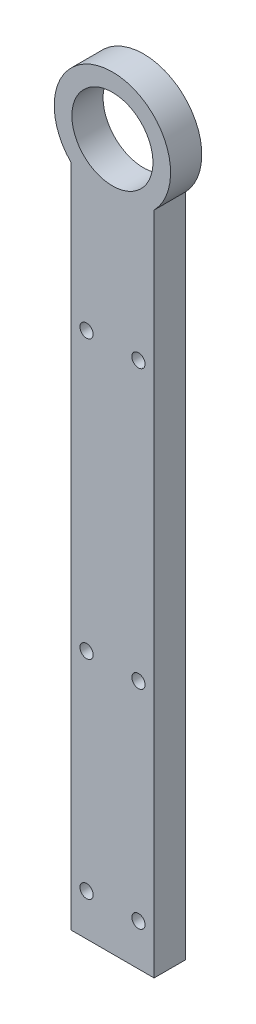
ISO-10303-21;
HEADER;
FILE_DESCRIPTION(('STEP AP214'),'2;1');
FILE_NAME('part.step','',(''),(''),'','','');
FILE_SCHEMA(('AUTOMOTIVE_DESIGN { 1 0 10303 214 1 1 1 1 }'));
ENDSEC;
DATA;
#1=APPLICATION_CONTEXT('core data for automotive mechanical design processes');
#2=APPLICATION_PROTOCOL_DEFINITION('international standard','automotive_design',2000,#1);
#3=PRODUCT_CONTEXT('',#1,'mechanical');
#4=PRODUCT('Part','Part','',(#3));
#5=PRODUCT_RELATED_PRODUCT_CATEGORY('part','',(#4));
#6=PRODUCT_DEFINITION_FORMATION('','',#4);
#7=PRODUCT_DEFINITION_CONTEXT('part definition',#1,'design');
#8=PRODUCT_DEFINITION('design','',#6,#7);
#9=PRODUCT_DEFINITION_SHAPE('','',#8);
#10=(LENGTH_UNIT() NAMED_UNIT(*) SI_UNIT(.MILLI.,.METRE.));
#11=(NAMED_UNIT(*) PLANE_ANGLE_UNIT() SI_UNIT($,.RADIAN.));
#12=(NAMED_UNIT(*) SI_UNIT($,.STERADIAN.) SOLID_ANGLE_UNIT());
#13=UNCERTAINTY_MEASURE_WITH_UNIT(LENGTH_MEASURE(1.E-05),#10,'distance_accuracy_value','');
#14=(GEOMETRIC_REPRESENTATION_CONTEXT(3) GLOBAL_UNCERTAINTY_ASSIGNED_CONTEXT((#13)) GLOBAL_UNIT_ASSIGNED_CONTEXT((#10,
#11,#12)) REPRESENTATION_CONTEXT('',''));
#15=CARTESIAN_POINT('',(0.,0.,0.));
#16=DIRECTION('',(0.,0.,1.));
#17=DIRECTION('',(1.,0.,0.));
#18=AXIS2_PLACEMENT_3D('',#15,#16,#17);
#19=CARTESIAN_POINT('',(0.,0.,9.525));
#20=DIRECTION('',(0.,0.,1.));
#21=DIRECTION('',(1.,0.,0.));
#22=AXIS2_PLACEMENT_3D('',#19,#20,#21);
#23=PLANE('',#22);
#24=CARTESIAN_POINT('',(-7.89318467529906,-139.411058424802,9.525));
#25=DIRECTION('',(0.,0.,1.));
#26=DIRECTION('',(1.,0.,0.));
#27=AXIS2_PLACEMENT_3D('',#24,#25,#26);
#28=CIRCLE('',#27,2.0193);
#29=CARTESIAN_POINT('',(-9.91248467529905,-139.411058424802,9.525));
#30=VERTEX_POINT('',#29);
#31=EDGE_CURVE('E139',#30,#30,#28,.T.);
#32=ORIENTED_EDGE('',*,*,#31,.F.);
#33=EDGE_LOOP('',(#32));
#34=FACE_BOUND('',#33,.T.);
#35=CARTESIAN_POINT('',(7.95641532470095,-202.911058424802,9.525));
#36=DIRECTION('',(0.,0.,1.));
#37=DIRECTION('',(1.,0.,0.));
#38=AXIS2_PLACEMENT_3D('',#35,#36,#37);
#39=CIRCLE('',#38,2.0193);
#40=CARTESIAN_POINT('',(5.93711532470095,-202.911058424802,9.525));
#41=VERTEX_POINT('',#40);
#42=EDGE_CURVE('E127',#41,#41,#39,.T.);
#43=ORIENTED_EDGE('',*,*,#42,.F.);
#44=EDGE_LOOP('',(#43));
#45=FACE_BOUND('',#44,.T.);
#46=CARTESIAN_POINT('',(-7.90588467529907,-54.6141933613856,9.525));
#47=DIRECTION('',(0.,0.,1.));
#48=DIRECTION('',(1.,0.,0.));
#49=AXIS2_PLACEMENT_3D('',#46,#47,#48);
#50=CIRCLE('',#49,2.0193);
#51=CARTESIAN_POINT('',(-9.92518467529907,-54.6141933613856,9.525));
#52=VERTEX_POINT('',#51);
#53=EDGE_CURVE('E115',#52,#52,#50,.T.);
#54=ORIENTED_EDGE('',*,*,#53,.F.);
#55=EDGE_LOOP('',(#54));
#56=FACE_BOUND('',#55,.T.);
#57=CARTESIAN_POINT('',(0.,0.,9.525));
#58=DIRECTION('',(0.,0.,1.));
#59=DIRECTION('',(1.,0.,0.));
#60=AXIS2_PLACEMENT_3D('',#57,#58,#59);
#61=CIRCLE('',#60,17.78);
#62=CARTESIAN_POINT('',(12.7316153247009,-12.4110584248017,9.525));
#63=VERTEX_POINT('',#62);
#64=CARTESIAN_POINT('',(-12.6683846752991,-12.4755933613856,9.525));
#65=VERTEX_POINT('',#64);
#66=EDGE_CURVE('E85',#63,#65,#61,.T.);
#67=ORIENTED_EDGE('',*,*,#66,.T.);
#68=DIRECTION('',(0.,-1.,0.));
#69=VECTOR('',#68,1.);
#70=CARTESIAN_POINT('',(-12.6683846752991,-12.4755933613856,9.525));
#71=LINE('',#70,#69);
#72=CARTESIAN_POINT('',(-12.6683846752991,-215.611058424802,9.525));
#73=VERTEX_POINT('',#72);
#74=EDGE_CURVE('E80',#65,#73,#71,.T.);
#75=ORIENTED_EDGE('',*,*,#74,.T.);
#76=DIRECTION('',(1.,0.,0.));
#77=VECTOR('',#76,1.);
#78=CARTESIAN_POINT('',(-12.6683846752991,-215.611058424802,9.525));
#79=LINE('',#78,#77);
#80=CARTESIAN_POINT('',(12.7316153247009,-215.611058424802,9.525));
#81=VERTEX_POINT('',#80);
#82=EDGE_CURVE('E83',#73,#81,#79,.T.);
#83=ORIENTED_EDGE('',*,*,#82,.T.);
#84=DIRECTION('',(0.,1.,0.));
#85=VECTOR('',#84,1.);
#86=CARTESIAN_POINT('',(12.7316153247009,-12.4110584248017,9.525));
#87=LINE('',#86,#85);
#88=EDGE_CURVE('E50',#81,#63,#87,.T.);
#89=ORIENTED_EDGE('',*,*,#88,.T.);
#90=EDGE_LOOP('',(#67,#75,#83,#89));
#91=FACE_BOUND('',#90,.T.);
#92=CARTESIAN_POINT('',(0.,0.,9.525));
#93=DIRECTION('',(0.,0.,1.));
#94=DIRECTION('',(1.,0.,0.));
#95=AXIS2_PLACEMENT_3D('',#92,#93,#94);
#96=CIRCLE('',#95,12.3825);
#97=CARTESIAN_POINT('',(-12.3825,0.,9.525));
#98=VERTEX_POINT('',#97);
#99=EDGE_CURVE('E100',#98,#98,#96,.T.);
#100=ORIENTED_EDGE('',*,*,#99,.F.);
#101=EDGE_LOOP('',(#100));
#102=FACE_BOUND('',#101,.T.);
#103=CARTESIAN_POINT('',(-7.89318467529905,-202.911058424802,9.525));
#104=DIRECTION('',(0.,0.,1.));
#105=DIRECTION('',(1.,0.,0.));
#106=AXIS2_PLACEMENT_3D('',#103,#104,#105);
#107=CIRCLE('',#106,2.01929999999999);
#108=CARTESIAN_POINT('',(-9.91248467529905,-202.911058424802,9.525));
#109=VERTEX_POINT('',#108);
#110=EDGE_CURVE('E121',#109,#109,#107,.T.);
#111=ORIENTED_EDGE('',*,*,#110,.F.);
#112=EDGE_LOOP('',(#111));
#113=FACE_BOUND('',#112,.T.);
#114=CARTESIAN_POINT('',(7.95641532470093,-54.5496584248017,9.525));
#115=DIRECTION('',(0.,0.,1.));
#116=DIRECTION('',(1.,0.,0.));
#117=AXIS2_PLACEMENT_3D('',#114,#115,#116);
#118=CIRCLE('',#117,2.0193);
#119=CARTESIAN_POINT('',(5.93711532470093,-54.5496584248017,9.525));
#120=VERTEX_POINT('',#119);
#121=EDGE_CURVE('E133',#120,#120,#118,.T.);
#122=ORIENTED_EDGE('',*,*,#121,.F.);
#123=EDGE_LOOP('',(#122));
#124=FACE_BOUND('',#123,.T.);
#125=CARTESIAN_POINT('',(7.95641532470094,-139.411058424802,9.525));
#126=DIRECTION('',(0.,0.,1.));
#127=DIRECTION('',(1.,0.,0.));
#128=AXIS2_PLACEMENT_3D('',#125,#126,#127);
#129=CIRCLE('',#128,2.01929999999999);
#130=CARTESIAN_POINT('',(5.93711532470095,-139.411058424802,9.525));
#131=VERTEX_POINT('',#130);
#132=EDGE_CURVE('E145',#131,#131,#129,.T.);
#133=ORIENTED_EDGE('',*,*,#132,.F.);
#134=EDGE_LOOP('',(#133));
#135=FACE_BOUND('',#134,.T.);
#136=ADVANCED_FACE('F33',(#34,#45,#56,#91,#102,#113,#124,#135),#23,.T.);
#137=CARTESIAN_POINT('',(0.,0.,0.));
#138=DIRECTION('',(0.,0.,1.));
#139=DIRECTION('',(1.,0.,0.));
#140=AXIS2_PLACEMENT_3D('',#137,#138,#139);
#141=PLANE('',#140);
#142=CARTESIAN_POINT('',(0.,0.,0.));
#143=DIRECTION('',(0.,0.,1.));
#144=DIRECTION('',(1.,0.,0.));
#145=AXIS2_PLACEMENT_3D('',#142,#143,#144);
#146=CIRCLE('',#145,17.78);
#147=CARTESIAN_POINT('',(12.7316153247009,-12.4110584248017,0.));
#148=VERTEX_POINT('',#147);
#149=CARTESIAN_POINT('',(-12.6683846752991,-12.4755933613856,0.));
#150=VERTEX_POINT('',#149);
#151=EDGE_CURVE('E97',#148,#150,#146,.T.);
#152=ORIENTED_EDGE('',*,*,#151,.F.);
#153=DIRECTION('',(0.,1.,0.));
#154=VECTOR('',#153,1.);
#155=CARTESIAN_POINT('',(12.7316153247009,-12.4110584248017,0.));
#156=LINE('',#155,#154);
#157=CARTESIAN_POINT('',(12.7316153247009,-215.611058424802,0.));
#158=VERTEX_POINT('',#157);
#159=EDGE_CURVE('E73',#158,#148,#156,.T.);
#160=ORIENTED_EDGE('',*,*,#159,.F.);
#161=DIRECTION('',(1.,0.,0.));
#162=VECTOR('',#161,1.);
#163=CARTESIAN_POINT('',(-12.6683846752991,-215.611058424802,0.));
#164=LINE('',#163,#162);
#165=CARTESIAN_POINT('',(-12.6683846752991,-215.611058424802,0.));
#166=VERTEX_POINT('',#165);
#167=EDGE_CURVE('E67',#166,#158,#164,.T.);
#168=ORIENTED_EDGE('',*,*,#167,.F.);
#169=DIRECTION('',(0.,-1.,0.));
#170=VECTOR('',#169,1.);
#171=CARTESIAN_POINT('',(-12.6683846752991,-12.4755933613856,0.));
#172=LINE('',#171,#170);
#173=EDGE_CURVE('E89',#150,#166,#172,.T.);
#174=ORIENTED_EDGE('',*,*,#173,.F.);
#175=EDGE_LOOP('',(#152,#160,#168,#174));
#176=FACE_BOUND('',#175,.T.);
#177=CARTESIAN_POINT('',(0.,0.,0.));
#178=DIRECTION('',(0.,0.,1.));
#179=DIRECTION('',(1.,0.,0.));
#180=AXIS2_PLACEMENT_3D('',#177,#178,#179);
#181=CIRCLE('',#180,12.3825);
#182=CARTESIAN_POINT('',(-12.3825,0.,0.));
#183=VERTEX_POINT('',#182);
#184=EDGE_CURVE('E112',#183,#183,#181,.T.);
#185=ORIENTED_EDGE('',*,*,#184,.T.);
#186=EDGE_LOOP('',(#185));
#187=FACE_BOUND('',#186,.T.);
#188=CARTESIAN_POINT('',(-7.90588467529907,-54.6141933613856,0.));
#189=DIRECTION('',(0.,0.,1.));
#190=DIRECTION('',(1.,0.,0.));
#191=AXIS2_PLACEMENT_3D('',#188,#189,#190);
#192=CIRCLE('',#191,2.0193);
#193=CARTESIAN_POINT('',(-9.92518467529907,-54.6141933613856,0.));
#194=VERTEX_POINT('',#193);
#195=EDGE_CURVE('E118',#194,#194,#192,.T.);
#196=ORIENTED_EDGE('',*,*,#195,.T.);
#197=EDGE_LOOP('',(#196));
#198=FACE_BOUND('',#197,.T.);
#199=CARTESIAN_POINT('',(-7.89318467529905,-202.911058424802,0.));
#200=DIRECTION('',(0.,0.,1.));
#201=DIRECTION('',(1.,0.,0.));
#202=AXIS2_PLACEMENT_3D('',#199,#200,#201);
#203=CIRCLE('',#202,2.01929999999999);
#204=CARTESIAN_POINT('',(-9.91248467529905,-202.911058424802,0.));
#205=VERTEX_POINT('',#204);
#206=EDGE_CURVE('E124',#205,#205,#203,.T.);
#207=ORIENTED_EDGE('',*,*,#206,.T.);
#208=EDGE_LOOP('',(#207));
#209=FACE_BOUND('',#208,.T.);
#210=CARTESIAN_POINT('',(7.95641532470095,-202.911058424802,0.));
#211=DIRECTION('',(0.,0.,1.));
#212=DIRECTION('',(1.,0.,0.));
#213=AXIS2_PLACEMENT_3D('',#210,#211,#212);
#214=CIRCLE('',#213,2.0193);
#215=CARTESIAN_POINT('',(5.93711532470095,-202.911058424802,0.));
#216=VERTEX_POINT('',#215);
#217=EDGE_CURVE('E130',#216,#216,#214,.T.);
#218=ORIENTED_EDGE('',*,*,#217,.T.);
#219=EDGE_LOOP('',(#218));
#220=FACE_BOUND('',#219,.T.);
#221=CARTESIAN_POINT('',(7.95641532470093,-54.5496584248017,0.));
#222=DIRECTION('',(0.,0.,1.));
#223=DIRECTION('',(1.,0.,0.));
#224=AXIS2_PLACEMENT_3D('',#221,#222,#223);
#225=CIRCLE('',#224,2.0193);
#226=CARTESIAN_POINT('',(5.93711532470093,-54.5496584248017,0.));
#227=VERTEX_POINT('',#226);
#228=EDGE_CURVE('E136',#227,#227,#225,.T.);
#229=ORIENTED_EDGE('',*,*,#228,.T.);
#230=EDGE_LOOP('',(#229));
#231=FACE_BOUND('',#230,.T.);
#232=CARTESIAN_POINT('',(-7.89318467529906,-139.411058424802,0.));
#233=DIRECTION('',(0.,0.,1.));
#234=DIRECTION('',(1.,0.,0.));
#235=AXIS2_PLACEMENT_3D('',#232,#233,#234);
#236=CIRCLE('',#235,2.0193);
#237=CARTESIAN_POINT('',(-9.91248467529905,-139.411058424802,0.));
#238=VERTEX_POINT('',#237);
#239=EDGE_CURVE('E142',#238,#238,#236,.T.);
#240=ORIENTED_EDGE('',*,*,#239,.T.);
#241=EDGE_LOOP('',(#240));
#242=FACE_BOUND('',#241,.T.);
#243=CARTESIAN_POINT('',(7.95641532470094,-139.411058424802,0.));
#244=DIRECTION('',(0.,0.,1.));
#245=DIRECTION('',(1.,0.,0.));
#246=AXIS2_PLACEMENT_3D('',#243,#244,#245);
#247=CIRCLE('',#246,2.01929999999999);
#248=CARTESIAN_POINT('',(5.93711532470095,-139.411058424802,0.));
#249=VERTEX_POINT('',#248);
#250=EDGE_CURVE('E148',#249,#249,#247,.T.);
#251=ORIENTED_EDGE('',*,*,#250,.T.);
#252=EDGE_LOOP('',(#251));
#253=FACE_BOUND('',#252,.T.);
#254=ADVANCED_FACE('F108',(#176,#187,#198,#209,#220,#231,#242,#253),#141,.F.);
#255=CARTESIAN_POINT('',(0.,0.,9.525));
#256=DIRECTION('',(0.,0.,-1.));
#257=DIRECTION('',(-1.,0.,0.));
#258=AXIS2_PLACEMENT_3D('',#255,#256,#257);
#259=CYLINDRICAL_SURFACE('',#258,17.78);
#260=ORIENTED_EDGE('',*,*,#151,.T.);
#261=DIRECTION('',(0.,0.,-1.));
#262=VECTOR('',#261,1.);
#263=CARTESIAN_POINT('',(-12.6683846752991,-12.4755933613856,9.525));
#264=LINE('',#263,#262);
#265=EDGE_CURVE('E11',#65,#150,#264,.T.);
#266=ORIENTED_EDGE('',*,*,#265,.F.);
#267=ORIENTED_EDGE('',*,*,#66,.F.);
#268=DIRECTION('',(0.,0.,-1.));
#269=VECTOR('',#268,1.);
#270=CARTESIAN_POINT('',(12.7316153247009,-12.4110584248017,9.525));
#271=LINE('',#270,#269);
#272=EDGE_CURVE('E93',#63,#148,#271,.T.);
#273=ORIENTED_EDGE('',*,*,#272,.T.);
#274=EDGE_LOOP('',(#260,#266,#267,#273));
#275=FACE_BOUND('',#274,.T.);
#276=ADVANCED_FACE('F35',(#275),#259,.T.);
#277=CARTESIAN_POINT('',(-12.6683846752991,-12.4755933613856,9.525));
#278=DIRECTION('',(1.,0.,0.));
#279=DIRECTION('',(0.,1.,0.));
#280=AXIS2_PLACEMENT_3D('',#277,#278,#279);
#281=PLANE('',#280);
#282=ORIENTED_EDGE('',*,*,#173,.T.);
#283=DIRECTION('',(0.,0.,-1.));
#284=VECTOR('',#283,1.);
#285=CARTESIAN_POINT('',(-12.6683846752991,-215.611058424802,9.525));
#286=LINE('',#285,#284);
#287=EDGE_CURVE('E42',#73,#166,#286,.T.);
#288=ORIENTED_EDGE('',*,*,#287,.F.);
#289=ORIENTED_EDGE('',*,*,#74,.F.);
#290=ORIENTED_EDGE('',*,*,#265,.T.);
#291=EDGE_LOOP('',(#282,#288,#289,#290));
#292=FACE_BOUND('',#291,.T.);
#293=ADVANCED_FACE('F88',(#292),#281,.F.);
#294=CARTESIAN_POINT('',(-12.6683846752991,-215.611058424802,9.525));
#295=DIRECTION('',(0.,1.,0.));
#296=DIRECTION('',(0.,0.,1.));
#297=AXIS2_PLACEMENT_3D('',#294,#295,#296);
#298=PLANE('',#297);
#299=ORIENTED_EDGE('',*,*,#167,.T.);
#300=DIRECTION('',(0.,0.,-1.));
#301=VECTOR('',#300,1.);
#302=CARTESIAN_POINT('',(12.7316153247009,-215.611058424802,9.525));
#303=LINE('',#302,#301);
#304=EDGE_CURVE('E90',#81,#158,#303,.T.);
#305=ORIENTED_EDGE('',*,*,#304,.F.);
#306=ORIENTED_EDGE('',*,*,#82,.F.);
#307=ORIENTED_EDGE('',*,*,#287,.T.);
#308=EDGE_LOOP('',(#299,#305,#306,#307));
#309=FACE_BOUND('',#308,.T.);
#310=ADVANCED_FACE('F91',(#309),#298,.F.);
#311=CARTESIAN_POINT('',(12.7316153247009,-12.4110584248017,9.525));
#312=DIRECTION('',(-1.,0.,0.));
#313=DIRECTION('',(0.,-1.,0.));
#314=AXIS2_PLACEMENT_3D('',#311,#312,#313);
#315=PLANE('',#314);
#316=ORIENTED_EDGE('',*,*,#159,.T.);
#317=ORIENTED_EDGE('',*,*,#272,.F.);
#318=ORIENTED_EDGE('',*,*,#88,.F.);
#319=ORIENTED_EDGE('',*,*,#304,.T.);
#320=EDGE_LOOP('',(#316,#317,#318,#319));
#321=FACE_BOUND('',#320,.T.);
#322=ADVANCED_FACE('F105',(#321),#315,.F.);
#323=CARTESIAN_POINT('',(0.,0.,9.525));
#324=DIRECTION('',(0.,0.,-1.));
#325=DIRECTION('',(-1.,0.,0.));
#326=AXIS2_PLACEMENT_3D('',#323,#324,#325);
#327=CYLINDRICAL_SURFACE('',#326,12.3825);
#328=CARTESIAN_POINT('',(-12.3825,0.,9.525));
#329=CARTESIAN_POINT('',(-12.3825,0.,9.42578125));
#330=CARTESIAN_POINT('',(-12.3825,0.,9.3265625));
#331=CARTESIAN_POINT('',(-12.3825,0.,9.128125));
#332=CARTESIAN_POINT('',(-12.3825,0.,9.02890625));
#333=CARTESIAN_POINT('',(-12.3825,0.,8.83046875));
#334=CARTESIAN_POINT('',(-12.3825,0.,8.73125));
#335=CARTESIAN_POINT('',(-12.3825,0.,8.5328125));
#336=CARTESIAN_POINT('',(-12.3825,0.,8.43359375));
#337=CARTESIAN_POINT('',(-12.3825,0.,8.23515625));
#338=CARTESIAN_POINT('',(-12.3825,0.,8.1359375));
#339=CARTESIAN_POINT('',(-12.3825,0.,7.9375));
#340=CARTESIAN_POINT('',(-12.3825,0.,7.83828125));
#341=CARTESIAN_POINT('',(-12.3825,0.,7.63984375));
#342=CARTESIAN_POINT('',(-12.3825,0.,7.540625));
#343=CARTESIAN_POINT('',(-12.3825,0.,7.3421875));
#344=CARTESIAN_POINT('',(-12.3825,0.,7.24296875));
#345=CARTESIAN_POINT('',(-12.3825,0.,7.04453125));
#346=CARTESIAN_POINT('',(-12.3825,0.,6.9453125));
#347=CARTESIAN_POINT('',(-12.3825,0.,6.746875));
#348=CARTESIAN_POINT('',(-12.3825,0.,6.64765625));
#349=CARTESIAN_POINT('',(-12.3825,0.,6.44921875));
#350=CARTESIAN_POINT('',(-12.3825,0.,6.35));
#351=CARTESIAN_POINT('',(-12.3825,0.,6.1515625));
#352=CARTESIAN_POINT('',(-12.3825,0.,6.05234375));
#353=CARTESIAN_POINT('',(-12.3825,0.,5.85390625));
#354=CARTESIAN_POINT('',(-12.3825,0.,5.7546875));
#355=CARTESIAN_POINT('',(-12.3825,0.,5.55625));
#356=CARTESIAN_POINT('',(-12.3825,0.,5.45703125));
#357=CARTESIAN_POINT('',(-12.3825,0.,5.25859375));
#358=CARTESIAN_POINT('',(-12.3825,0.,5.159375));
#359=CARTESIAN_POINT('',(-12.3825,0.,4.9609375));
#360=CARTESIAN_POINT('',(-12.3825,0.,4.86171875));
#361=CARTESIAN_POINT('',(-12.3825,0.,4.66328125));
#362=CARTESIAN_POINT('',(-12.3825,0.,4.5640625));
#363=CARTESIAN_POINT('',(-12.3825,0.,4.365625));
#364=CARTESIAN_POINT('',(-12.3825,0.,4.26640625));
#365=CARTESIAN_POINT('',(-12.3825,0.,4.06796875));
#366=CARTESIAN_POINT('',(-12.3825,0.,3.96875));
#367=CARTESIAN_POINT('',(-12.3825,0.,3.7703125));
#368=CARTESIAN_POINT('',(-12.3825,0.,3.67109375));
#369=CARTESIAN_POINT('',(-12.3825,0.,3.47265625));
#370=CARTESIAN_POINT('',(-12.3825,0.,3.3734375));
#371=CARTESIAN_POINT('',(-12.3825,0.,3.175));
#372=CARTESIAN_POINT('',(-12.3825,0.,3.07578125));
#373=CARTESIAN_POINT('',(-12.3825,0.,2.87734375));
#374=CARTESIAN_POINT('',(-12.3825,0.,2.778125));
#375=CARTESIAN_POINT('',(-12.3825,0.,2.5796875));
#376=CARTESIAN_POINT('',(-12.3825,0.,2.48046875));
#377=CARTESIAN_POINT('',(-12.3825,0.,2.28203125));
#378=CARTESIAN_POINT('',(-12.3825,0.,2.1828125));
#379=CARTESIAN_POINT('',(-12.3825,0.,1.984375));
#380=CARTESIAN_POINT('',(-12.3825,0.,1.88515625));
#381=CARTESIAN_POINT('',(-12.3825,0.,1.68671875));
#382=CARTESIAN_POINT('',(-12.3825,0.,1.5875));
#383=CARTESIAN_POINT('',(-12.3825,0.,1.3890625));
#384=CARTESIAN_POINT('',(-12.3825,0.,1.28984375));
#385=CARTESIAN_POINT('',(-12.3825,0.,1.09140625));
#386=CARTESIAN_POINT('',(-12.3825,0.,0.992187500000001));
#387=CARTESIAN_POINT('',(-12.3825,0.,0.793750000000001));
#388=CARTESIAN_POINT('',(-12.3825,0.,0.69453125));
#389=CARTESIAN_POINT('',(-12.3825,0.,0.49609375));
#390=CARTESIAN_POINT('',(-12.3825,0.,0.396875));
#391=CARTESIAN_POINT('',(-12.3825,0.,0.1984375));
#392=CARTESIAN_POINT('',(-12.3825,0.,0.0992187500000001));
#393=CARTESIAN_POINT('',(-12.3825,0.,0.));
#394=B_SPLINE_CURVE_WITH_KNOTS('',3,(#328,#329,#330,#331,#332,#333,#334,#335,#336,#337,#338,
#339,#340,#341,#342,#343,#344,#345,#346,#347,#348,#349,#350,#351,#352,#353,#354,#355,#356,#357,
#358,#359,#360,#361,#362,#363,#364,#365,#366,#367,#368,#369,#370,#371,#372,#373,#374,#375,#376,
#377,#378,#379,#380,#381,#382,#383,#384,#385,#386,#387,#388,#389,#390,#391,#392,#393),
.UNSPECIFIED.,.F.,.F.,(4,2,2,2,2,2,2,2,2,2,2,2,2,2,2,2,2,2,2,2,2,2,2,2,2,2,2,2,2,2,2,2,4),(0.,
0.297656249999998,0.595312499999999,0.892968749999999,1.190625,1.48828125,1.7859375,2.08359375,
2.38125,2.67890625,2.9765625,3.27421875,3.571875,3.86953125,4.1671875,4.46484375,4.7625,
5.06015625,5.3578125,5.65546875,5.953125,6.25078125,6.5484375,6.84609375,7.14375,7.44140625,
7.7390625,8.03671875,8.334375,8.63203125,8.9296875,9.22734375,9.525),.UNSPECIFIED.);
#395=EDGE_CURVE('BSEAM167',#98,#183,#394,.T.);
#396=ORIENTED_EDGE('',*,*,#99,.T.);
#397=ORIENTED_EDGE('',*,*,#184,.F.);
#398=ORIENTED_EDGE('',*,*,#395,.T.);
#399=ORIENTED_EDGE('',*,*,#395,.F.);
#400=EDGE_LOOP('',(#396,#398,#397,#399));
#401=FACE_BOUND('',#400,.T.);
#402=ADVANCED_FACE('F167',(#401),#327,.F.);
#403=CARTESIAN_POINT('',(-7.90588467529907,-54.6141933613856,9.525));
#404=DIRECTION('',(0.,0.,-1.));
#405=DIRECTION('',(-1.,0.,0.));
#406=AXIS2_PLACEMENT_3D('',#403,#404,#405);
#407=CYLINDRICAL_SURFACE('',#406,2.0193);
#408=CARTESIAN_POINT('',(-9.92518467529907,-54.6141933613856,9.525));
#409=CARTESIAN_POINT('',(-9.92518467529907,-54.6141933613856,9.42578125));
#410=CARTESIAN_POINT('',(-9.92518467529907,-54.6141933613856,9.3265625));
#411=CARTESIAN_POINT('',(-9.92518467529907,-54.6141933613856,9.128125));
#412=CARTESIAN_POINT('',(-9.92518467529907,-54.6141933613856,9.02890625));
#413=CARTESIAN_POINT('',(-9.92518467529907,-54.6141933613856,8.83046875));
#414=CARTESIAN_POINT('',(-9.92518467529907,-54.6141933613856,8.73125));
#415=CARTESIAN_POINT('',(-9.92518467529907,-54.6141933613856,8.5328125));
#416=CARTESIAN_POINT('',(-9.92518467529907,-54.6141933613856,8.43359375));
#417=CARTESIAN_POINT('',(-9.92518467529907,-54.6141933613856,8.23515625));
#418=CARTESIAN_POINT('',(-9.92518467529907,-54.6141933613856,8.1359375));
#419=CARTESIAN_POINT('',(-9.92518467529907,-54.6141933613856,7.9375));
#420=CARTESIAN_POINT('',(-9.92518467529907,-54.6141933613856,7.83828125));
#421=CARTESIAN_POINT('',(-9.92518467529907,-54.6141933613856,7.63984375));
#422=CARTESIAN_POINT('',(-9.92518467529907,-54.6141933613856,7.540625));
#423=CARTESIAN_POINT('',(-9.92518467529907,-54.6141933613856,7.3421875));
#424=CARTESIAN_POINT('',(-9.92518467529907,-54.6141933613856,7.24296875));
#425=CARTESIAN_POINT('',(-9.92518467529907,-54.6141933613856,7.04453125));
#426=CARTESIAN_POINT('',(-9.92518467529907,-54.6141933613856,6.9453125));
#427=CARTESIAN_POINT('',(-9.92518467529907,-54.6141933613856,6.746875));
#428=CARTESIAN_POINT('',(-9.92518467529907,-54.6141933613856,6.64765625));
#429=CARTESIAN_POINT('',(-9.92518467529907,-54.6141933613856,6.44921875));
#430=CARTESIAN_POINT('',(-9.92518467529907,-54.6141933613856,6.35));
#431=CARTESIAN_POINT('',(-9.92518467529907,-54.6141933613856,6.1515625));
#432=CARTESIAN_POINT('',(-9.92518467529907,-54.6141933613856,6.05234375));
#433=CARTESIAN_POINT('',(-9.92518467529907,-54.6141933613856,5.85390625));
#434=CARTESIAN_POINT('',(-9.92518467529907,-54.6141933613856,5.7546875));
#435=CARTESIAN_POINT('',(-9.92518467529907,-54.6141933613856,5.55625));
#436=CARTESIAN_POINT('',(-9.92518467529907,-54.6141933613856,5.45703125));
#437=CARTESIAN_POINT('',(-9.92518467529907,-54.6141933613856,5.25859375));
#438=CARTESIAN_POINT('',(-9.92518467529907,-54.6141933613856,5.159375));
#439=CARTESIAN_POINT('',(-9.92518467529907,-54.6141933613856,4.9609375));
#440=CARTESIAN_POINT('',(-9.92518467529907,-54.6141933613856,4.86171875));
#441=CARTESIAN_POINT('',(-9.92518467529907,-54.6141933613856,4.66328125));
#442=CARTESIAN_POINT('',(-9.92518467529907,-54.6141933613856,4.5640625));
#443=CARTESIAN_POINT('',(-9.92518467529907,-54.6141933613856,4.365625));
#444=CARTESIAN_POINT('',(-9.92518467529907,-54.6141933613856,4.26640625));
#445=CARTESIAN_POINT('',(-9.92518467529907,-54.6141933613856,4.06796875));
#446=CARTESIAN_POINT('',(-9.92518467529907,-54.6141933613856,3.96875));
#447=CARTESIAN_POINT('',(-9.92518467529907,-54.6141933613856,3.7703125));
#448=CARTESIAN_POINT('',(-9.92518467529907,-54.6141933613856,3.67109375));
#449=CARTESIAN_POINT('',(-9.92518467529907,-54.6141933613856,3.47265625));
#450=CARTESIAN_POINT('',(-9.92518467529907,-54.6141933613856,3.3734375));
#451=CARTESIAN_POINT('',(-9.92518467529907,-54.6141933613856,3.175));
#452=CARTESIAN_POINT('',(-9.92518467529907,-54.6141933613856,3.07578125));
#453=CARTESIAN_POINT('',(-9.92518467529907,-54.6141933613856,2.87734375));
#454=CARTESIAN_POINT('',(-9.92518467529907,-54.6141933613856,2.778125));
#455=CARTESIAN_POINT('',(-9.92518467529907,-54.6141933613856,2.5796875));
#456=CARTESIAN_POINT('',(-9.92518467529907,-54.6141933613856,2.48046875));
#457=CARTESIAN_POINT('',(-9.92518467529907,-54.6141933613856,2.28203125));
#458=CARTESIAN_POINT('',(-9.92518467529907,-54.6141933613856,2.1828125));
#459=CARTESIAN_POINT('',(-9.92518467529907,-54.6141933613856,1.984375));
#460=CARTESIAN_POINT('',(-9.92518467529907,-54.6141933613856,1.88515625));
#461=CARTESIAN_POINT('',(-9.92518467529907,-54.6141933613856,1.68671875));
#462=CARTESIAN_POINT('',(-9.92518467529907,-54.6141933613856,1.5875));
#463=CARTESIAN_POINT('',(-9.92518467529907,-54.6141933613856,1.3890625));
#464=CARTESIAN_POINT('',(-9.92518467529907,-54.6141933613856,1.28984375));
#465=CARTESIAN_POINT('',(-9.92518467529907,-54.6141933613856,1.09140625));
#466=CARTESIAN_POINT('',(-9.92518467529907,-54.6141933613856,0.992187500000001));
#467=CARTESIAN_POINT('',(-9.92518467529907,-54.6141933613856,0.793750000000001));
#468=CARTESIAN_POINT('',(-9.92518467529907,-54.6141933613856,0.69453125));
#469=CARTESIAN_POINT('',(-9.92518467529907,-54.6141933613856,0.49609375));
#470=CARTESIAN_POINT('',(-9.92518467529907,-54.6141933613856,0.396875));
#471=CARTESIAN_POINT('',(-9.92518467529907,-54.6141933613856,0.1984375));
#472=CARTESIAN_POINT('',(-9.92518467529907,-54.6141933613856,0.0992187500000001));
#473=CARTESIAN_POINT('',(-9.92518467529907,-54.6141933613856,0.));
#474=B_SPLINE_CURVE_WITH_KNOTS('',3,(#408,#409,#410,#411,#412,#413,#414,#415,#416,#417,#418,
#419,#420,#421,#422,#423,#424,#425,#426,#427,#428,#429,#430,#431,#432,#433,#434,#435,#436,#437,
#438,#439,#440,#441,#442,#443,#444,#445,#446,#447,#448,#449,#450,#451,#452,#453,#454,#455,#456,
#457,#458,#459,#460,#461,#462,#463,#464,#465,#466,#467,#468,#469,#470,#471,#472,#473),
.UNSPECIFIED.,.F.,.F.,(4,2,2,2,2,2,2,2,2,2,2,2,2,2,2,2,2,2,2,2,2,2,2,2,2,2,2,2,2,2,2,2,4),(0.,
0.29765625,0.5953125,0.892968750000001,1.190625,1.48828125,1.7859375,2.08359375,2.38125,
2.67890625,2.9765625,3.27421875,3.571875,3.86953125,4.1671875,4.46484375,4.7625,5.06015625,
5.3578125,5.65546875,5.953125,6.25078125,6.5484375,6.84609375,7.14375,7.44140625,7.7390625,
8.03671875,8.334375,8.63203125,8.9296875,9.22734375,9.525),.UNSPECIFIED.);
#475=EDGE_CURVE('BSEAM213',#52,#194,#474,.T.);
#476=ORIENTED_EDGE('',*,*,#53,.T.);
#477=ORIENTED_EDGE('',*,*,#195,.F.);
#478=ORIENTED_EDGE('',*,*,#475,.T.);
#479=ORIENTED_EDGE('',*,*,#475,.F.);
#480=EDGE_LOOP('',(#476,#478,#477,#479));
#481=FACE_BOUND('',#480,.T.);
#482=ADVANCED_FACE('F213',(#481),#407,.F.);
#483=CARTESIAN_POINT('',(-7.89318467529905,-202.911058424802,9.525));
#484=DIRECTION('',(0.,0.,-1.));
#485=DIRECTION('',(-1.,0.,0.));
#486=AXIS2_PLACEMENT_3D('',#483,#484,#485);
#487=CYLINDRICAL_SURFACE('',#486,2.01929999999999);
#488=CARTESIAN_POINT('',(-9.91248467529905,-202.911058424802,9.525));
#489=CARTESIAN_POINT('',(-9.91248467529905,-202.911058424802,9.42578125));
#490=CARTESIAN_POINT('',(-9.91248467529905,-202.911058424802,9.3265625));
#491=CARTESIAN_POINT('',(-9.91248467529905,-202.911058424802,9.128125));
#492=CARTESIAN_POINT('',(-9.91248467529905,-202.911058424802,9.02890625));
#493=CARTESIAN_POINT('',(-9.91248467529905,-202.911058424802,8.83046875));
#494=CARTESIAN_POINT('',(-9.91248467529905,-202.911058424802,8.73125));
#495=CARTESIAN_POINT('',(-9.91248467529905,-202.911058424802,8.5328125));
#496=CARTESIAN_POINT('',(-9.91248467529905,-202.911058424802,8.43359375));
#497=CARTESIAN_POINT('',(-9.91248467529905,-202.911058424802,8.23515625));
#498=CARTESIAN_POINT('',(-9.91248467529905,-202.911058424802,8.1359375));
#499=CARTESIAN_POINT('',(-9.91248467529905,-202.911058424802,7.9375));
#500=CARTESIAN_POINT('',(-9.91248467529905,-202.911058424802,7.83828125));
#501=CARTESIAN_POINT('',(-9.91248467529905,-202.911058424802,7.63984375));
#502=CARTESIAN_POINT('',(-9.91248467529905,-202.911058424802,7.540625));
#503=CARTESIAN_POINT('',(-9.91248467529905,-202.911058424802,7.3421875));
#504=CARTESIAN_POINT('',(-9.91248467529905,-202.911058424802,7.24296875));
#505=CARTESIAN_POINT('',(-9.91248467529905,-202.911058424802,7.04453125));
#506=CARTESIAN_POINT('',(-9.91248467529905,-202.911058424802,6.9453125));
#507=CARTESIAN_POINT('',(-9.91248467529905,-202.911058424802,6.746875));
#508=CARTESIAN_POINT('',(-9.91248467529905,-202.911058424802,6.64765625));
#509=CARTESIAN_POINT('',(-9.91248467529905,-202.911058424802,6.44921875));
#510=CARTESIAN_POINT('',(-9.91248467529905,-202.911058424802,6.35));
#511=CARTESIAN_POINT('',(-9.91248467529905,-202.911058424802,6.1515625));
#512=CARTESIAN_POINT('',(-9.91248467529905,-202.911058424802,6.05234375));
#513=CARTESIAN_POINT('',(-9.91248467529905,-202.911058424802,5.85390625));
#514=CARTESIAN_POINT('',(-9.91248467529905,-202.911058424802,5.7546875));
#515=CARTESIAN_POINT('',(-9.91248467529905,-202.911058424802,5.55625));
#516=CARTESIAN_POINT('',(-9.91248467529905,-202.911058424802,5.45703125));
#517=CARTESIAN_POINT('',(-9.91248467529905,-202.911058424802,5.25859375));
#518=CARTESIAN_POINT('',(-9.91248467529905,-202.911058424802,5.159375));
#519=CARTESIAN_POINT('',(-9.91248467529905,-202.911058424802,4.9609375));
#520=CARTESIAN_POINT('',(-9.91248467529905,-202.911058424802,4.86171875));
#521=CARTESIAN_POINT('',(-9.91248467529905,-202.911058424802,4.66328125));
#522=CARTESIAN_POINT('',(-9.91248467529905,-202.911058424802,4.5640625));
#523=CARTESIAN_POINT('',(-9.91248467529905,-202.911058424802,4.365625));
#524=CARTESIAN_POINT('',(-9.91248467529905,-202.911058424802,4.26640625));
#525=CARTESIAN_POINT('',(-9.91248467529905,-202.911058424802,4.06796875));
#526=CARTESIAN_POINT('',(-9.91248467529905,-202.911058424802,3.96875));
#527=CARTESIAN_POINT('',(-9.91248467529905,-202.911058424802,3.7703125));
#528=CARTESIAN_POINT('',(-9.91248467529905,-202.911058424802,3.67109375));
#529=CARTESIAN_POINT('',(-9.91248467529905,-202.911058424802,3.47265625));
#530=CARTESIAN_POINT('',(-9.91248467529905,-202.911058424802,3.3734375));
#531=CARTESIAN_POINT('',(-9.91248467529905,-202.911058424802,3.175));
#532=CARTESIAN_POINT('',(-9.91248467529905,-202.911058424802,3.07578125));
#533=CARTESIAN_POINT('',(-9.91248467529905,-202.911058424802,2.87734375));
#534=CARTESIAN_POINT('',(-9.91248467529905,-202.911058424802,2.778125));
#535=CARTESIAN_POINT('',(-9.91248467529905,-202.911058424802,2.5796875));
#536=CARTESIAN_POINT('',(-9.91248467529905,-202.911058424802,2.48046875));
#537=CARTESIAN_POINT('',(-9.91248467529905,-202.911058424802,2.28203125));
#538=CARTESIAN_POINT('',(-9.91248467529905,-202.911058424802,2.1828125));
#539=CARTESIAN_POINT('',(-9.91248467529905,-202.911058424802,1.984375));
#540=CARTESIAN_POINT('',(-9.91248467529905,-202.911058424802,1.88515625));
#541=CARTESIAN_POINT('',(-9.91248467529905,-202.911058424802,1.68671875));
#542=CARTESIAN_POINT('',(-9.91248467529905,-202.911058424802,1.5875));
#543=CARTESIAN_POINT('',(-9.91248467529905,-202.911058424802,1.3890625));
#544=CARTESIAN_POINT('',(-9.91248467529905,-202.911058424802,1.28984375));
#545=CARTESIAN_POINT('',(-9.91248467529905,-202.911058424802,1.09140625));
#546=CARTESIAN_POINT('',(-9.91248467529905,-202.911058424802,0.992187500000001));
#547=CARTESIAN_POINT('',(-9.91248467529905,-202.911058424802,0.793750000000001));
#548=CARTESIAN_POINT('',(-9.91248467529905,-202.911058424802,0.69453125));
#549=CARTESIAN_POINT('',(-9.91248467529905,-202.911058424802,0.49609375));
#550=CARTESIAN_POINT('',(-9.91248467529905,-202.911058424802,0.396875));
#551=CARTESIAN_POINT('',(-9.91248467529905,-202.911058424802,0.1984375));
#552=CARTESIAN_POINT('',(-9.91248467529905,-202.911058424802,0.0992187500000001));
#553=CARTESIAN_POINT('',(-9.91248467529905,-202.911058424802,0.));
#554=B_SPLINE_CURVE_WITH_KNOTS('',3,(#488,#489,#490,#491,#492,#493,#494,#495,#496,#497,#498,
#499,#500,#501,#502,#503,#504,#505,#506,#507,#508,#509,#510,#511,#512,#513,#514,#515,#516,#517,
#518,#519,#520,#521,#522,#523,#524,#525,#526,#527,#528,#529,#530,#531,#532,#533,#534,#535,#536,
#537,#538,#539,#540,#541,#542,#543,#544,#545,#546,#547,#548,#549,#550,#551,#552,#553),
.UNSPECIFIED.,.F.,.F.,(4,2,2,2,2,2,2,2,2,2,2,2,2,2,2,2,2,2,2,2,2,2,2,2,2,2,2,2,2,2,2,2,4),(0.,
0.29765625,0.5953125,0.892968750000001,1.190625,1.48828125,1.7859375,2.08359375,2.38125,
2.67890625,2.9765625,3.27421875,3.571875,3.86953125,4.1671875,4.46484375,4.7625,5.06015625,
5.3578125,5.65546875,5.953125,6.25078125,6.5484375,6.84609375,7.14375,7.44140625,7.7390625,
8.03671875,8.334375,8.63203125,8.9296875,9.22734375,9.525),.UNSPECIFIED.);
#555=EDGE_CURVE('BSEAM221',#109,#205,#554,.T.);
#556=ORIENTED_EDGE('',*,*,#110,.T.);
#557=ORIENTED_EDGE('',*,*,#206,.F.);
#558=ORIENTED_EDGE('',*,*,#555,.T.);
#559=ORIENTED_EDGE('',*,*,#555,.F.);
#560=EDGE_LOOP('',(#556,#558,#557,#559));
#561=FACE_BOUND('',#560,.T.);
#562=ADVANCED_FACE('F221',(#561),#487,.F.);
#563=CARTESIAN_POINT('',(7.95641532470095,-202.911058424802,9.525));
#564=DIRECTION('',(0.,0.,-1.));
#565=DIRECTION('',(-1.,0.,0.));
#566=AXIS2_PLACEMENT_3D('',#563,#564,#565);
#567=CYLINDRICAL_SURFACE('',#566,2.0193);
#568=CARTESIAN_POINT('',(5.93711532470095,-202.911058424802,9.525));
#569=CARTESIAN_POINT('',(5.93711532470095,-202.911058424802,9.42578125));
#570=CARTESIAN_POINT('',(5.93711532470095,-202.911058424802,9.3265625));
#571=CARTESIAN_POINT('',(5.93711532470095,-202.911058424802,9.128125));
#572=CARTESIAN_POINT('',(5.93711532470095,-202.911058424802,9.02890625));
#573=CARTESIAN_POINT('',(5.93711532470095,-202.911058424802,8.83046875));
#574=CARTESIAN_POINT('',(5.93711532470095,-202.911058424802,8.73125));
#575=CARTESIAN_POINT('',(5.93711532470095,-202.911058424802,8.5328125));
#576=CARTESIAN_POINT('',(5.93711532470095,-202.911058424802,8.43359375));
#577=CARTESIAN_POINT('',(5.93711532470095,-202.911058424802,8.23515625));
#578=CARTESIAN_POINT('',(5.93711532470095,-202.911058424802,8.1359375));
#579=CARTESIAN_POINT('',(5.93711532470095,-202.911058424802,7.9375));
#580=CARTESIAN_POINT('',(5.93711532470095,-202.911058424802,7.83828125));
#581=CARTESIAN_POINT('',(5.93711532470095,-202.911058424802,7.63984375));
#582=CARTESIAN_POINT('',(5.93711532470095,-202.911058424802,7.540625));
#583=CARTESIAN_POINT('',(5.93711532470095,-202.911058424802,7.3421875));
#584=CARTESIAN_POINT('',(5.93711532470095,-202.911058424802,7.24296875));
#585=CARTESIAN_POINT('',(5.93711532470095,-202.911058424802,7.04453125));
#586=CARTESIAN_POINT('',(5.93711532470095,-202.911058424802,6.9453125));
#587=CARTESIAN_POINT('',(5.93711532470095,-202.911058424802,6.746875));
#588=CARTESIAN_POINT('',(5.93711532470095,-202.911058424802,6.64765625));
#589=CARTESIAN_POINT('',(5.93711532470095,-202.911058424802,6.44921875));
#590=CARTESIAN_POINT('',(5.93711532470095,-202.911058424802,6.35));
#591=CARTESIAN_POINT('',(5.93711532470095,-202.911058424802,6.1515625));
#592=CARTESIAN_POINT('',(5.93711532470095,-202.911058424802,6.05234375));
#593=CARTESIAN_POINT('',(5.93711532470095,-202.911058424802,5.85390625));
#594=CARTESIAN_POINT('',(5.93711532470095,-202.911058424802,5.7546875));
#595=CARTESIAN_POINT('',(5.93711532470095,-202.911058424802,5.55625));
#596=CARTESIAN_POINT('',(5.93711532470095,-202.911058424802,5.45703125));
#597=CARTESIAN_POINT('',(5.93711532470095,-202.911058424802,5.25859375));
#598=CARTESIAN_POINT('',(5.93711532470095,-202.911058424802,5.159375));
#599=CARTESIAN_POINT('',(5.93711532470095,-202.911058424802,4.9609375));
#600=CARTESIAN_POINT('',(5.93711532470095,-202.911058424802,4.86171875));
#601=CARTESIAN_POINT('',(5.93711532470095,-202.911058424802,4.66328125));
#602=CARTESIAN_POINT('',(5.93711532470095,-202.911058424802,4.5640625));
#603=CARTESIAN_POINT('',(5.93711532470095,-202.911058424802,4.365625));
#604=CARTESIAN_POINT('',(5.93711532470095,-202.911058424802,4.26640625));
#605=CARTESIAN_POINT('',(5.93711532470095,-202.911058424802,4.06796875));
#606=CARTESIAN_POINT('',(5.93711532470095,-202.911058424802,3.96875));
#607=CARTESIAN_POINT('',(5.93711532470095,-202.911058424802,3.7703125));
#608=CARTESIAN_POINT('',(5.93711532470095,-202.911058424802,3.67109375));
#609=CARTESIAN_POINT('',(5.93711532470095,-202.911058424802,3.47265625));
#610=CARTESIAN_POINT('',(5.93711532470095,-202.911058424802,3.3734375));
#611=CARTESIAN_POINT('',(5.93711532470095,-202.911058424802,3.175));
#612=CARTESIAN_POINT('',(5.93711532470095,-202.911058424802,3.07578125));
#613=CARTESIAN_POINT('',(5.93711532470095,-202.911058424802,2.87734375));
#614=CARTESIAN_POINT('',(5.93711532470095,-202.911058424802,2.778125));
#615=CARTESIAN_POINT('',(5.93711532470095,-202.911058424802,2.5796875));
#616=CARTESIAN_POINT('',(5.93711532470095,-202.911058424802,2.48046875));
#617=CARTESIAN_POINT('',(5.93711532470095,-202.911058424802,2.28203125));
#618=CARTESIAN_POINT('',(5.93711532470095,-202.911058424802,2.1828125));
#619=CARTESIAN_POINT('',(5.93711532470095,-202.911058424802,1.984375));
#620=CARTESIAN_POINT('',(5.93711532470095,-202.911058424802,1.88515625));
#621=CARTESIAN_POINT('',(5.93711532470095,-202.911058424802,1.68671875));
#622=CARTESIAN_POINT('',(5.93711532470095,-202.911058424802,1.5875));
#623=CARTESIAN_POINT('',(5.93711532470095,-202.911058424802,1.3890625));
#624=CARTESIAN_POINT('',(5.93711532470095,-202.911058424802,1.28984375));
#625=CARTESIAN_POINT('',(5.93711532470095,-202.911058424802,1.09140625));
#626=CARTESIAN_POINT('',(5.93711532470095,-202.911058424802,0.992187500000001));
#627=CARTESIAN_POINT('',(5.93711532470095,-202.911058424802,0.793750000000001));
#628=CARTESIAN_POINT('',(5.93711532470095,-202.911058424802,0.69453125));
#629=CARTESIAN_POINT('',(5.93711532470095,-202.911058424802,0.49609375));
#630=CARTESIAN_POINT('',(5.93711532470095,-202.911058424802,0.396875));
#631=CARTESIAN_POINT('',(5.93711532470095,-202.911058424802,0.1984375));
#632=CARTESIAN_POINT('',(5.93711532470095,-202.911058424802,0.0992187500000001));
#633=CARTESIAN_POINT('',(5.93711532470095,-202.911058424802,0.));
#634=B_SPLINE_CURVE_WITH_KNOTS('',3,(#568,#569,#570,#571,#572,#573,#574,#575,#576,#577,#578,
#579,#580,#581,#582,#583,#584,#585,#586,#587,#588,#589,#590,#591,#592,#593,#594,#595,#596,#597,
#598,#599,#600,#601,#602,#603,#604,#605,#606,#607,#608,#609,#610,#611,#612,#613,#614,#615,#616,
#617,#618,#619,#620,#621,#622,#623,#624,#625,#626,#627,#628,#629,#630,#631,#632,#633),
.UNSPECIFIED.,.F.,.F.,(4,2,2,2,2,2,2,2,2,2,2,2,2,2,2,2,2,2,2,2,2,2,2,2,2,2,2,2,2,2,2,2,4),(0.,
0.29765625,0.5953125,0.892968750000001,1.190625,1.48828125,1.7859375,2.08359375,2.38125,
2.67890625,2.9765625,3.27421875,3.571875,3.86953125,4.1671875,4.46484375,4.7625,5.06015625,
5.3578125,5.65546875,5.953125,6.25078125,6.5484375,6.84609375,7.14375,7.44140625,7.7390625,
8.03671875,8.334375,8.63203125,8.9296875,9.22734375,9.525),.UNSPECIFIED.);
#635=EDGE_CURVE('BSEAM229',#41,#216,#634,.T.);
#636=ORIENTED_EDGE('',*,*,#42,.T.);
#637=ORIENTED_EDGE('',*,*,#217,.F.);
#638=ORIENTED_EDGE('',*,*,#635,.T.);
#639=ORIENTED_EDGE('',*,*,#635,.F.);
#640=EDGE_LOOP('',(#636,#638,#637,#639));
#641=FACE_BOUND('',#640,.T.);
#642=ADVANCED_FACE('F229',(#641),#567,.F.);
#643=CARTESIAN_POINT('',(7.95641532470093,-54.5496584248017,9.525));
#644=DIRECTION('',(0.,0.,-1.));
#645=DIRECTION('',(-1.,0.,0.));
#646=AXIS2_PLACEMENT_3D('',#643,#644,#645);
#647=CYLINDRICAL_SURFACE('',#646,2.0193);
#648=CARTESIAN_POINT('',(5.93711532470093,-54.5496584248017,9.525));
#649=CARTESIAN_POINT('',(5.93711532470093,-54.5496584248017,9.42578125));
#650=CARTESIAN_POINT('',(5.93711532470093,-54.5496584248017,9.3265625));
#651=CARTESIAN_POINT('',(5.93711532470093,-54.5496584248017,9.128125));
#652=CARTESIAN_POINT('',(5.93711532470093,-54.5496584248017,9.02890625));
#653=CARTESIAN_POINT('',(5.93711532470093,-54.5496584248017,8.83046875));
#654=CARTESIAN_POINT('',(5.93711532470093,-54.5496584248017,8.73125));
#655=CARTESIAN_POINT('',(5.93711532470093,-54.5496584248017,8.5328125));
#656=CARTESIAN_POINT('',(5.93711532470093,-54.5496584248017,8.43359375));
#657=CARTESIAN_POINT('',(5.93711532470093,-54.5496584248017,8.23515625));
#658=CARTESIAN_POINT('',(5.93711532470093,-54.5496584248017,8.1359375));
#659=CARTESIAN_POINT('',(5.93711532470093,-54.5496584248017,7.9375));
#660=CARTESIAN_POINT('',(5.93711532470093,-54.5496584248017,7.83828125));
#661=CARTESIAN_POINT('',(5.93711532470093,-54.5496584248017,7.63984375));
#662=CARTESIAN_POINT('',(5.93711532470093,-54.5496584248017,7.540625));
#663=CARTESIAN_POINT('',(5.93711532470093,-54.5496584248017,7.3421875));
#664=CARTESIAN_POINT('',(5.93711532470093,-54.5496584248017,7.24296875));
#665=CARTESIAN_POINT('',(5.93711532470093,-54.5496584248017,7.04453125));
#666=CARTESIAN_POINT('',(5.93711532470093,-54.5496584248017,6.9453125));
#667=CARTESIAN_POINT('',(5.93711532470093,-54.5496584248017,6.746875));
#668=CARTESIAN_POINT('',(5.93711532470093,-54.5496584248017,6.64765625));
#669=CARTESIAN_POINT('',(5.93711532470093,-54.5496584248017,6.44921875));
#670=CARTESIAN_POINT('',(5.93711532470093,-54.5496584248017,6.35));
#671=CARTESIAN_POINT('',(5.93711532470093,-54.5496584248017,6.1515625));
#672=CARTESIAN_POINT('',(5.93711532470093,-54.5496584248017,6.05234375));
#673=CARTESIAN_POINT('',(5.93711532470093,-54.5496584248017,5.85390625));
#674=CARTESIAN_POINT('',(5.93711532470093,-54.5496584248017,5.7546875));
#675=CARTESIAN_POINT('',(5.93711532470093,-54.5496584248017,5.55625));
#676=CARTESIAN_POINT('',(5.93711532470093,-54.5496584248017,5.45703125));
#677=CARTESIAN_POINT('',(5.93711532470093,-54.5496584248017,5.25859375));
#678=CARTESIAN_POINT('',(5.93711532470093,-54.5496584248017,5.159375));
#679=CARTESIAN_POINT('',(5.93711532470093,-54.5496584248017,4.9609375));
#680=CARTESIAN_POINT('',(5.93711532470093,-54.5496584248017,4.86171875));
#681=CARTESIAN_POINT('',(5.93711532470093,-54.5496584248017,4.66328125));
#682=CARTESIAN_POINT('',(5.93711532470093,-54.5496584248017,4.5640625));
#683=CARTESIAN_POINT('',(5.93711532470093,-54.5496584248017,4.365625));
#684=CARTESIAN_POINT('',(5.93711532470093,-54.5496584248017,4.26640625));
#685=CARTESIAN_POINT('',(5.93711532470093,-54.5496584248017,4.06796875));
#686=CARTESIAN_POINT('',(5.93711532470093,-54.5496584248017,3.96875));
#687=CARTESIAN_POINT('',(5.93711532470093,-54.5496584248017,3.7703125));
#688=CARTESIAN_POINT('',(5.93711532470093,-54.5496584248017,3.67109375));
#689=CARTESIAN_POINT('',(5.93711532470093,-54.5496584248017,3.47265625));
#690=CARTESIAN_POINT('',(5.93711532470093,-54.5496584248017,3.3734375));
#691=CARTESIAN_POINT('',(5.93711532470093,-54.5496584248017,3.175));
#692=CARTESIAN_POINT('',(5.93711532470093,-54.5496584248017,3.07578125));
#693=CARTESIAN_POINT('',(5.93711532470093,-54.5496584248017,2.87734375));
#694=CARTESIAN_POINT('',(5.93711532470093,-54.5496584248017,2.778125));
#695=CARTESIAN_POINT('',(5.93711532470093,-54.5496584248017,2.5796875));
#696=CARTESIAN_POINT('',(5.93711532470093,-54.5496584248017,2.48046875));
#697=CARTESIAN_POINT('',(5.93711532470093,-54.5496584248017,2.28203125));
#698=CARTESIAN_POINT('',(5.93711532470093,-54.5496584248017,2.1828125));
#699=CARTESIAN_POINT('',(5.93711532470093,-54.5496584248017,1.984375));
#700=CARTESIAN_POINT('',(5.93711532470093,-54.5496584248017,1.88515625));
#701=CARTESIAN_POINT('',(5.93711532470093,-54.5496584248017,1.68671875));
#702=CARTESIAN_POINT('',(5.93711532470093,-54.5496584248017,1.5875));
#703=CARTESIAN_POINT('',(5.93711532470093,-54.5496584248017,1.3890625));
#704=CARTESIAN_POINT('',(5.93711532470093,-54.5496584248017,1.28984375));
#705=CARTESIAN_POINT('',(5.93711532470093,-54.5496584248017,1.09140625));
#706=CARTESIAN_POINT('',(5.93711532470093,-54.5496584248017,0.992187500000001));
#707=CARTESIAN_POINT('',(5.93711532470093,-54.5496584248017,0.793750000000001));
#708=CARTESIAN_POINT('',(5.93711532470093,-54.5496584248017,0.69453125));
#709=CARTESIAN_POINT('',(5.93711532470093,-54.5496584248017,0.49609375));
#710=CARTESIAN_POINT('',(5.93711532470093,-54.5496584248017,0.396875));
#711=CARTESIAN_POINT('',(5.93711532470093,-54.5496584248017,0.1984375));
#712=CARTESIAN_POINT('',(5.93711532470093,-54.5496584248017,0.0992187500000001));
#713=CARTESIAN_POINT('',(5.93711532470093,-54.5496584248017,0.));
#714=B_SPLINE_CURVE_WITH_KNOTS('',3,(#648,#649,#650,#651,#652,#653,#654,#655,#656,#657,#658,
#659,#660,#661,#662,#663,#664,#665,#666,#667,#668,#669,#670,#671,#672,#673,#674,#675,#676,#677,
#678,#679,#680,#681,#682,#683,#684,#685,#686,#687,#688,#689,#690,#691,#692,#693,#694,#695,#696,
#697,#698,#699,#700,#701,#702,#703,#704,#705,#706,#707,#708,#709,#710,#711,#712,#713),
.UNSPECIFIED.,.F.,.F.,(4,2,2,2,2,2,2,2,2,2,2,2,2,2,2,2,2,2,2,2,2,2,2,2,2,2,2,2,2,2,2,2,4),(0.,
0.29765625,0.5953125,0.892968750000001,1.190625,1.48828125,1.7859375,2.08359375,2.38125,
2.67890625,2.9765625,3.27421875,3.571875,3.86953125,4.1671875,4.46484375,4.7625,5.06015625,
5.3578125,5.65546875,5.953125,6.25078125,6.5484375,6.84609375,7.14375,7.44140625,7.7390625,
8.03671875,8.334375,8.63203125,8.9296875,9.22734375,9.525),.UNSPECIFIED.);
#715=EDGE_CURVE('BSEAM238',#120,#227,#714,.T.);
#716=ORIENTED_EDGE('',*,*,#121,.T.);
#717=ORIENTED_EDGE('',*,*,#228,.F.);
#718=ORIENTED_EDGE('',*,*,#715,.T.);
#719=ORIENTED_EDGE('',*,*,#715,.F.);
#720=EDGE_LOOP('',(#716,#718,#717,#719));
#721=FACE_BOUND('',#720,.T.);
#722=ADVANCED_FACE('F238',(#721),#647,.F.);
#723=CARTESIAN_POINT('',(-7.89318467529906,-139.411058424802,9.525));
#724=DIRECTION('',(0.,0.,-1.));
#725=DIRECTION('',(-1.,0.,0.));
#726=AXIS2_PLACEMENT_3D('',#723,#724,#725);
#727=CYLINDRICAL_SURFACE('',#726,2.0193);
#728=CARTESIAN_POINT('',(-9.91248467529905,-139.411058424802,9.525));
#729=CARTESIAN_POINT('',(-9.91248467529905,-139.411058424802,9.42578125));
#730=CARTESIAN_POINT('',(-9.91248467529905,-139.411058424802,9.3265625));
#731=CARTESIAN_POINT('',(-9.91248467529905,-139.411058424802,9.128125));
#732=CARTESIAN_POINT('',(-9.91248467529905,-139.411058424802,9.02890625));
#733=CARTESIAN_POINT('',(-9.91248467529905,-139.411058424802,8.83046875));
#734=CARTESIAN_POINT('',(-9.91248467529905,-139.411058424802,8.73125));
#735=CARTESIAN_POINT('',(-9.91248467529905,-139.411058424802,8.5328125));
#736=CARTESIAN_POINT('',(-9.91248467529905,-139.411058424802,8.43359375));
#737=CARTESIAN_POINT('',(-9.91248467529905,-139.411058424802,8.23515625));
#738=CARTESIAN_POINT('',(-9.91248467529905,-139.411058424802,8.1359375));
#739=CARTESIAN_POINT('',(-9.91248467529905,-139.411058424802,7.9375));
#740=CARTESIAN_POINT('',(-9.91248467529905,-139.411058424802,7.83828125));
#741=CARTESIAN_POINT('',(-9.91248467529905,-139.411058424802,7.63984375));
#742=CARTESIAN_POINT('',(-9.91248467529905,-139.411058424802,7.540625));
#743=CARTESIAN_POINT('',(-9.91248467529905,-139.411058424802,7.3421875));
#744=CARTESIAN_POINT('',(-9.91248467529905,-139.411058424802,7.24296875));
#745=CARTESIAN_POINT('',(-9.91248467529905,-139.411058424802,7.04453125));
#746=CARTESIAN_POINT('',(-9.91248467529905,-139.411058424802,6.9453125));
#747=CARTESIAN_POINT('',(-9.91248467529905,-139.411058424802,6.746875));
#748=CARTESIAN_POINT('',(-9.91248467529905,-139.411058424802,6.64765625));
#749=CARTESIAN_POINT('',(-9.91248467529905,-139.411058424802,6.44921875));
#750=CARTESIAN_POINT('',(-9.91248467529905,-139.411058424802,6.35));
#751=CARTESIAN_POINT('',(-9.91248467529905,-139.411058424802,6.1515625));
#752=CARTESIAN_POINT('',(-9.91248467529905,-139.411058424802,6.05234375));
#753=CARTESIAN_POINT('',(-9.91248467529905,-139.411058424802,5.85390625));
#754=CARTESIAN_POINT('',(-9.91248467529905,-139.411058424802,5.7546875));
#755=CARTESIAN_POINT('',(-9.91248467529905,-139.411058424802,5.55625));
#756=CARTESIAN_POINT('',(-9.91248467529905,-139.411058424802,5.45703125));
#757=CARTESIAN_POINT('',(-9.91248467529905,-139.411058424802,5.25859375));
#758=CARTESIAN_POINT('',(-9.91248467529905,-139.411058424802,5.159375));
#759=CARTESIAN_POINT('',(-9.91248467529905,-139.411058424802,4.9609375));
#760=CARTESIAN_POINT('',(-9.91248467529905,-139.411058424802,4.86171875));
#761=CARTESIAN_POINT('',(-9.91248467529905,-139.411058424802,4.66328125));
#762=CARTESIAN_POINT('',(-9.91248467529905,-139.411058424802,4.5640625));
#763=CARTESIAN_POINT('',(-9.91248467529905,-139.411058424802,4.365625));
#764=CARTESIAN_POINT('',(-9.91248467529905,-139.411058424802,4.26640625));
#765=CARTESIAN_POINT('',(-9.91248467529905,-139.411058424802,4.06796875));
#766=CARTESIAN_POINT('',(-9.91248467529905,-139.411058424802,3.96875));
#767=CARTESIAN_POINT('',(-9.91248467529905,-139.411058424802,3.7703125));
#768=CARTESIAN_POINT('',(-9.91248467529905,-139.411058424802,3.67109375));
#769=CARTESIAN_POINT('',(-9.91248467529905,-139.411058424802,3.47265625));
#770=CARTESIAN_POINT('',(-9.91248467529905,-139.411058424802,3.3734375));
#771=CARTESIAN_POINT('',(-9.91248467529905,-139.411058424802,3.175));
#772=CARTESIAN_POINT('',(-9.91248467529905,-139.411058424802,3.07578125));
#773=CARTESIAN_POINT('',(-9.91248467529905,-139.411058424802,2.87734375));
#774=CARTESIAN_POINT('',(-9.91248467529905,-139.411058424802,2.778125));
#775=CARTESIAN_POINT('',(-9.91248467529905,-139.411058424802,2.5796875));
#776=CARTESIAN_POINT('',(-9.91248467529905,-139.411058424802,2.48046875));
#777=CARTESIAN_POINT('',(-9.91248467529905,-139.411058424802,2.28203125));
#778=CARTESIAN_POINT('',(-9.91248467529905,-139.411058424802,2.1828125));
#779=CARTESIAN_POINT('',(-9.91248467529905,-139.411058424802,1.984375));
#780=CARTESIAN_POINT('',(-9.91248467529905,-139.411058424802,1.88515625));
#781=CARTESIAN_POINT('',(-9.91248467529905,-139.411058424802,1.68671875));
#782=CARTESIAN_POINT('',(-9.91248467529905,-139.411058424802,1.5875));
#783=CARTESIAN_POINT('',(-9.91248467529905,-139.411058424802,1.3890625));
#784=CARTESIAN_POINT('',(-9.91248467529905,-139.411058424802,1.28984375));
#785=CARTESIAN_POINT('',(-9.91248467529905,-139.411058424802,1.09140625));
#786=CARTESIAN_POINT('',(-9.91248467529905,-139.411058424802,0.992187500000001));
#787=CARTESIAN_POINT('',(-9.91248467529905,-139.411058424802,0.793750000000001));
#788=CARTESIAN_POINT('',(-9.91248467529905,-139.411058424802,0.69453125));
#789=CARTESIAN_POINT('',(-9.91248467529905,-139.411058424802,0.49609375));
#790=CARTESIAN_POINT('',(-9.91248467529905,-139.411058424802,0.396875));
#791=CARTESIAN_POINT('',(-9.91248467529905,-139.411058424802,0.1984375));
#792=CARTESIAN_POINT('',(-9.91248467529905,-139.411058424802,0.0992187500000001));
#793=CARTESIAN_POINT('',(-9.91248467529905,-139.411058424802,0.));
#794=B_SPLINE_CURVE_WITH_KNOTS('',3,(#728,#729,#730,#731,#732,#733,#734,#735,#736,#737,#738,
#739,#740,#741,#742,#743,#744,#745,#746,#747,#748,#749,#750,#751,#752,#753,#754,#755,#756,#757,
#758,#759,#760,#761,#762,#763,#764,#765,#766,#767,#768,#769,#770,#771,#772,#773,#774,#775,#776,
#777,#778,#779,#780,#781,#782,#783,#784,#785,#786,#787,#788,#789,#790,#791,#792,#793),
.UNSPECIFIED.,.F.,.F.,(4,2,2,2,2,2,2,2,2,2,2,2,2,2,2,2,2,2,2,2,2,2,2,2,2,2,2,2,2,2,2,2,4),(0.,
0.29765625,0.5953125,0.892968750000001,1.190625,1.48828125,1.7859375,2.08359375,2.38125,
2.67890625,2.9765625,3.27421875,3.571875,3.86953125,4.1671875,4.46484375,4.7625,5.06015625,
5.3578125,5.65546875,5.953125,6.25078125,6.5484375,6.84609375,7.14375,7.44140625,7.7390625,
8.03671875,8.334375,8.63203125,8.9296875,9.22734375,9.525),.UNSPECIFIED.);
#795=EDGE_CURVE('BSEAM247',#30,#238,#794,.T.);
#796=ORIENTED_EDGE('',*,*,#31,.T.);
#797=ORIENTED_EDGE('',*,*,#239,.F.);
#798=ORIENTED_EDGE('',*,*,#795,.T.);
#799=ORIENTED_EDGE('',*,*,#795,.F.);
#800=EDGE_LOOP('',(#796,#798,#797,#799));
#801=FACE_BOUND('',#800,.T.);
#802=ADVANCED_FACE('F247',(#801),#727,.F.);
#803=CARTESIAN_POINT('',(7.95641532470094,-139.411058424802,9.525));
#804=DIRECTION('',(0.,0.,-1.));
#805=DIRECTION('',(-1.,0.,0.));
#806=AXIS2_PLACEMENT_3D('',#803,#804,#805);
#807=CYLINDRICAL_SURFACE('',#806,2.01929999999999);
#808=CARTESIAN_POINT('',(5.93711532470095,-139.411058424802,9.525));
#809=CARTESIAN_POINT('',(5.93711532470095,-139.411058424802,9.42578125));
#810=CARTESIAN_POINT('',(5.93711532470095,-139.411058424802,9.3265625));
#811=CARTESIAN_POINT('',(5.93711532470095,-139.411058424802,9.128125));
#812=CARTESIAN_POINT('',(5.93711532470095,-139.411058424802,9.02890625));
#813=CARTESIAN_POINT('',(5.93711532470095,-139.411058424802,8.83046875));
#814=CARTESIAN_POINT('',(5.93711532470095,-139.411058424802,8.73125));
#815=CARTESIAN_POINT('',(5.93711532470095,-139.411058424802,8.5328125));
#816=CARTESIAN_POINT('',(5.93711532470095,-139.411058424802,8.43359375));
#817=CARTESIAN_POINT('',(5.93711532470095,-139.411058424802,8.23515625));
#818=CARTESIAN_POINT('',(5.93711532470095,-139.411058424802,8.1359375));
#819=CARTESIAN_POINT('',(5.93711532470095,-139.411058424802,7.9375));
#820=CARTESIAN_POINT('',(5.93711532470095,-139.411058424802,7.83828125));
#821=CARTESIAN_POINT('',(5.93711532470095,-139.411058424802,7.63984375));
#822=CARTESIAN_POINT('',(5.93711532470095,-139.411058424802,7.540625));
#823=CARTESIAN_POINT('',(5.93711532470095,-139.411058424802,7.3421875));
#824=CARTESIAN_POINT('',(5.93711532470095,-139.411058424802,7.24296875));
#825=CARTESIAN_POINT('',(5.93711532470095,-139.411058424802,7.04453125));
#826=CARTESIAN_POINT('',(5.93711532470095,-139.411058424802,6.9453125));
#827=CARTESIAN_POINT('',(5.93711532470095,-139.411058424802,6.746875));
#828=CARTESIAN_POINT('',(5.93711532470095,-139.411058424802,6.64765625));
#829=CARTESIAN_POINT('',(5.93711532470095,-139.411058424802,6.44921875));
#830=CARTESIAN_POINT('',(5.93711532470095,-139.411058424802,6.35));
#831=CARTESIAN_POINT('',(5.93711532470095,-139.411058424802,6.1515625));
#832=CARTESIAN_POINT('',(5.93711532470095,-139.411058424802,6.05234375));
#833=CARTESIAN_POINT('',(5.93711532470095,-139.411058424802,5.85390625));
#834=CARTESIAN_POINT('',(5.93711532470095,-139.411058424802,5.7546875));
#835=CARTESIAN_POINT('',(5.93711532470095,-139.411058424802,5.55625));
#836=CARTESIAN_POINT('',(5.93711532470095,-139.411058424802,5.45703125));
#837=CARTESIAN_POINT('',(5.93711532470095,-139.411058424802,5.25859375));
#838=CARTESIAN_POINT('',(5.93711532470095,-139.411058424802,5.159375));
#839=CARTESIAN_POINT('',(5.93711532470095,-139.411058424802,4.9609375));
#840=CARTESIAN_POINT('',(5.93711532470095,-139.411058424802,4.86171875));
#841=CARTESIAN_POINT('',(5.93711532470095,-139.411058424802,4.66328125));
#842=CARTESIAN_POINT('',(5.93711532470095,-139.411058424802,4.5640625));
#843=CARTESIAN_POINT('',(5.93711532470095,-139.411058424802,4.365625));
#844=CARTESIAN_POINT('',(5.93711532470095,-139.411058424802,4.26640625));
#845=CARTESIAN_POINT('',(5.93711532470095,-139.411058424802,4.06796875));
#846=CARTESIAN_POINT('',(5.93711532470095,-139.411058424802,3.96875));
#847=CARTESIAN_POINT('',(5.93711532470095,-139.411058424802,3.7703125));
#848=CARTESIAN_POINT('',(5.93711532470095,-139.411058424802,3.67109375));
#849=CARTESIAN_POINT('',(5.93711532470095,-139.411058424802,3.47265625));
#850=CARTESIAN_POINT('',(5.93711532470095,-139.411058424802,3.3734375));
#851=CARTESIAN_POINT('',(5.93711532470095,-139.411058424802,3.175));
#852=CARTESIAN_POINT('',(5.93711532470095,-139.411058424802,3.07578125));
#853=CARTESIAN_POINT('',(5.93711532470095,-139.411058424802,2.87734375));
#854=CARTESIAN_POINT('',(5.93711532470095,-139.411058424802,2.778125));
#855=CARTESIAN_POINT('',(5.93711532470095,-139.411058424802,2.5796875));
#856=CARTESIAN_POINT('',(5.93711532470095,-139.411058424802,2.48046875));
#857=CARTESIAN_POINT('',(5.93711532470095,-139.411058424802,2.28203125));
#858=CARTESIAN_POINT('',(5.93711532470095,-139.411058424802,2.1828125));
#859=CARTESIAN_POINT('',(5.93711532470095,-139.411058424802,1.984375));
#860=CARTESIAN_POINT('',(5.93711532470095,-139.411058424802,1.88515625));
#861=CARTESIAN_POINT('',(5.93711532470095,-139.411058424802,1.68671875));
#862=CARTESIAN_POINT('',(5.93711532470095,-139.411058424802,1.5875));
#863=CARTESIAN_POINT('',(5.93711532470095,-139.411058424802,1.3890625));
#864=CARTESIAN_POINT('',(5.93711532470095,-139.411058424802,1.28984375));
#865=CARTESIAN_POINT('',(5.93711532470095,-139.411058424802,1.09140625));
#866=CARTESIAN_POINT('',(5.93711532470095,-139.411058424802,0.992187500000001));
#867=CARTESIAN_POINT('',(5.93711532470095,-139.411058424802,0.793750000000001));
#868=CARTESIAN_POINT('',(5.93711532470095,-139.411058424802,0.69453125));
#869=CARTESIAN_POINT('',(5.93711532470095,-139.411058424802,0.49609375));
#870=CARTESIAN_POINT('',(5.93711532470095,-139.411058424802,0.396875));
#871=CARTESIAN_POINT('',(5.93711532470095,-139.411058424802,0.1984375));
#872=CARTESIAN_POINT('',(5.93711532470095,-139.411058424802,0.0992187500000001));
#873=CARTESIAN_POINT('',(5.93711532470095,-139.411058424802,0.));
#874=B_SPLINE_CURVE_WITH_KNOTS('',3,(#808,#809,#810,#811,#812,#813,#814,#815,#816,#817,#818,
#819,#820,#821,#822,#823,#824,#825,#826,#827,#828,#829,#830,#831,#832,#833,#834,#835,#836,#837,
#838,#839,#840,#841,#842,#843,#844,#845,#846,#847,#848,#849,#850,#851,#852,#853,#854,#855,#856,
#857,#858,#859,#860,#861,#862,#863,#864,#865,#866,#867,#868,#869,#870,#871,#872,#873),
.UNSPECIFIED.,.F.,.F.,(4,2,2,2,2,2,2,2,2,2,2,2,2,2,2,2,2,2,2,2,2,2,2,2,2,2,2,2,2,2,2,2,4),(0.,
0.29765625,0.5953125,0.892968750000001,1.190625,1.48828125,1.7859375,2.08359375,2.38125,
2.67890625,2.9765625,3.27421875,3.571875,3.86953125,4.1671875,4.46484375,4.7625,5.06015625,
5.3578125,5.65546875,5.953125,6.25078125,6.5484375,6.84609375,7.14375,7.44140625,7.7390625,
8.03671875,8.334375,8.63203125,8.9296875,9.22734375,9.525),.UNSPECIFIED.);
#875=EDGE_CURVE('BSEAM154',#131,#249,#874,.T.);
#876=ORIENTED_EDGE('',*,*,#132,.T.);
#877=ORIENTED_EDGE('',*,*,#250,.F.);
#878=ORIENTED_EDGE('',*,*,#875,.T.);
#879=ORIENTED_EDGE('',*,*,#875,.F.);
#880=EDGE_LOOP('',(#876,#878,#877,#879));
#881=FACE_BOUND('',#880,.T.);
#882=ADVANCED_FACE('F154',(#881),#807,.F.);
#883=CLOSED_SHELL('',(#136,#254,#276,#293,#310,#322,#402,#482,#562,#642,#722,#802,#882));
#884=MANIFOLD_SOLID_BREP('B2',#883);
#885=ADVANCED_BREP_SHAPE_REPRESENTATION('',(#18,#884),#14);
#886=SHAPE_DEFINITION_REPRESENTATION(#9,#885);
ENDSEC;
END-ISO-10303-21;
